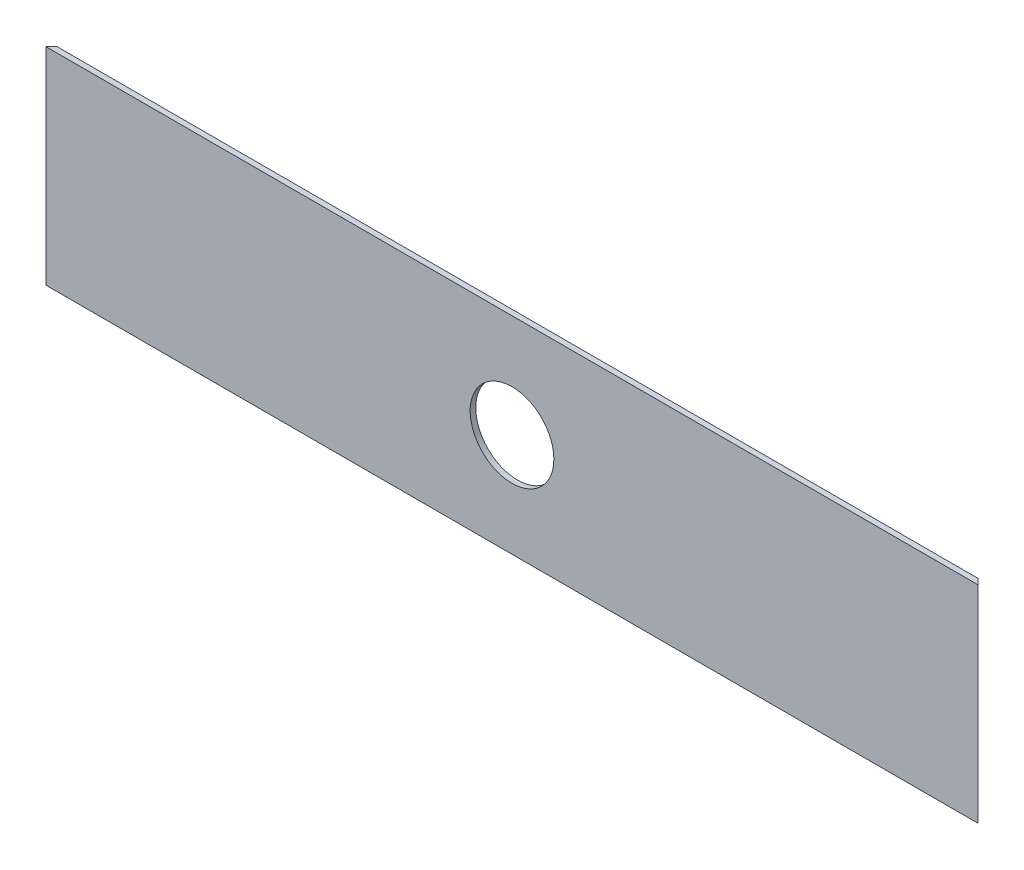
ISO-10303-21;
HEADER;
FILE_DESCRIPTION(('STEP AP214'),'2;1');
FILE_NAME('part.step','',(''),(''),'','','');
FILE_SCHEMA(('AUTOMOTIVE_DESIGN { 1 0 10303 214 1 1 1 1 }'));
ENDSEC;
DATA;
#1=APPLICATION_CONTEXT('core data for automotive mechanical design processes');
#2=APPLICATION_PROTOCOL_DEFINITION('international standard','automotive_design',2000,#1);
#3=PRODUCT_CONTEXT('',#1,'mechanical');
#4=PRODUCT('Part','Part','',(#3));
#5=PRODUCT_RELATED_PRODUCT_CATEGORY('part','',(#4));
#6=PRODUCT_DEFINITION_FORMATION('','',#4);
#7=PRODUCT_DEFINITION_CONTEXT('part definition',#1,'design');
#8=PRODUCT_DEFINITION('design','',#6,#7);
#9=PRODUCT_DEFINITION_SHAPE('','',#8);
#10=(LENGTH_UNIT() NAMED_UNIT(*) SI_UNIT(.MILLI.,.METRE.));
#11=(NAMED_UNIT(*) PLANE_ANGLE_UNIT() SI_UNIT($,.RADIAN.));
#12=(NAMED_UNIT(*) SI_UNIT($,.STERADIAN.) SOLID_ANGLE_UNIT());
#13=UNCERTAINTY_MEASURE_WITH_UNIT(LENGTH_MEASURE(1.E-05),#10,'distance_accuracy_value','');
#14=(GEOMETRIC_REPRESENTATION_CONTEXT(3) GLOBAL_UNCERTAINTY_ASSIGNED_CONTEXT((#13)) GLOBAL_UNIT_ASSIGNED_CONTEXT((#10,
#11,#12)) REPRESENTATION_CONTEXT('',''));
#15=CARTESIAN_POINT('',(0.,0.,0.));
#16=DIRECTION('',(0.,0.,1.));
#17=DIRECTION('',(1.,0.,0.));
#18=AXIS2_PLACEMENT_3D('',#15,#16,#17);
#19=CARTESIAN_POINT('',(0.,185.075,10.));
#20=DIRECTION('',(0.,0.,1.));
#21=DIRECTION('',(1.,0.,0.));
#22=AXIS2_PLACEMENT_3D('',#19,#20,#21);
#23=PLANE('',#22);
#24=CARTESIAN_POINT('',(0.,185.0772745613,10.));
#25=DIRECTION('',(0.,0.,1.));
#26=DIRECTION('',(1.,0.,0.));
#27=AXIS2_PLACEMENT_3D('',#24,#25,#26);
#28=CIRCLE('',#27,75.);
#29=CARTESIAN_POINT('',(75.,185.0772745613,10.));
#30=VERTEX_POINT('',#29);
#31=EDGE_CURVE('E10',#30,#30,#28,.T.);
#32=ORIENTED_EDGE('',*,*,#31,.F.);
#33=EDGE_LOOP('',(#32));
#34=FACE_BOUND('',#33,.T.);
#35=DIRECTION('',(1.,0.,0.));
#36=VECTOR('',#35,1.);
#37=CARTESIAN_POINT('',(-835.,0.,10.));
#38=LINE('',#37,#36);
#39=CARTESIAN_POINT('',(-835.,0.,10.));
#40=VERTEX_POINT('',#39);
#41=CARTESIAN_POINT('',(835.,0.,10.));
#42=VERTEX_POINT('',#41);
#43=EDGE_CURVE('E80',#40,#42,#38,.T.);
#44=ORIENTED_EDGE('',*,*,#43,.T.);
#45=DIRECTION('',(0.,1.,0.));
#46=VECTOR('',#45,1.);
#47=CARTESIAN_POINT('',(835.,0.,10.));
#48=LINE('',#47,#46);
#49=CARTESIAN_POINT('',(835.,370.15,10.));
#50=VERTEX_POINT('',#49);
#51=EDGE_CURVE('E19',#42,#50,#48,.T.);
#52=ORIENTED_EDGE('',*,*,#51,.T.);
#53=DIRECTION('',(-1.,0.,0.));
#54=VECTOR('',#53,1.);
#55=CARTESIAN_POINT('',(835.,370.15,10.));
#56=LINE('',#55,#54);
#57=CARTESIAN_POINT('',(-835.,370.15,10.));
#58=VERTEX_POINT('',#57);
#59=EDGE_CURVE('E115',#50,#58,#56,.T.);
#60=ORIENTED_EDGE('',*,*,#59,.T.);
#61=DIRECTION('',(0.,-1.,0.));
#62=VECTOR('',#61,1.);
#63=CARTESIAN_POINT('',(-835.,370.15,10.));
#64=LINE('',#63,#62);
#65=EDGE_CURVE('E86',#58,#40,#64,.T.);
#66=ORIENTED_EDGE('',*,*,#65,.T.);
#67=EDGE_LOOP('',(#44,#52,#60,#66));
#68=FACE_BOUND('',#67,.T.);
#69=ADVANCED_FACE('F16',(#34,#68),#23,.T.);
#70=CARTESIAN_POINT('',(0.,185.0772745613,-1.));
#71=DIRECTION('',(0.,0.,1.));
#72=DIRECTION('',(1.,0.,0.));
#73=AXIS2_PLACEMENT_3D('',#70,#71,#72);
#74=CYLINDRICAL_SURFACE('',#73,75.);
#75=DIRECTION('',(0.,0.,1.));
#76=VECTOR('',#75,1.);
#77=CARTESIAN_POINT('',(75.,185.0772745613,-1.));
#78=LINE('',#77,#76);
#79=CARTESIAN_POINT('',(75.,185.0772745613,0.));
#80=VERTEX_POINT('',#79);
#81=EDGE_CURVE('E26',#80,#30,#78,.T.);
#82=ORIENTED_EDGE('',*,*,#81,.F.);
#83=CARTESIAN_POINT('',(0.,185.0772745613,0.));
#84=DIRECTION('',(0.,0.,1.));
#85=DIRECTION('',(1.,0.,0.));
#86=AXIS2_PLACEMENT_3D('',#83,#84,#85);
#87=CIRCLE('',#86,75.);
#88=EDGE_CURVE('E87',#80,#80,#87,.T.);
#89=ORIENTED_EDGE('',*,*,#88,.F.);
#90=ORIENTED_EDGE('',*,*,#81,.T.);
#91=ORIENTED_EDGE('',*,*,#31,.T.);
#92=EDGE_LOOP('',(#82,#89,#90,#91));
#93=FACE_BOUND('',#92,.T.);
#94=ADVANCED_FACE('F176',(#93),#74,.F.);
#95=CARTESIAN_POINT('',(830.,185.075,5.));
#96=DIRECTION('',(0.707106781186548,0.,-0.707106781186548));
#97=DIRECTION('',(0.,-1.,0.));
#98=AXIS2_PLACEMENT_3D('',#95,#96,#97);
#99=PLANE('',#98);
#100=DIRECTION('',(0.,-1.,0.));
#101=VECTOR('',#100,1.);
#102=CARTESIAN_POINT('',(825.,370.15,0.));
#103=LINE('',#102,#101);
#104=CARTESIAN_POINT('',(825.,370.15,0.));
#105=VERTEX_POINT('',#104);
#106=CARTESIAN_POINT('',(825.,0.,0.));
#107=VERTEX_POINT('',#106);
#108=EDGE_CURVE('E95',#105,#107,#103,.T.);
#109=ORIENTED_EDGE('',*,*,#108,.F.);
#110=DIRECTION('',(0.707106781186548,0.,0.707106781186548));
#111=VECTOR('',#110,1.);
#112=CARTESIAN_POINT('',(825.,370.15,0.));
#113=LINE('',#112,#111);
#114=EDGE_CURVE('E111',#105,#50,#113,.T.);
#115=ORIENTED_EDGE('',*,*,#114,.T.);
#116=ORIENTED_EDGE('',*,*,#51,.F.);
#117=DIRECTION('',(0.707106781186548,0.,0.707106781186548));
#118=VECTOR('',#117,1.);
#119=CARTESIAN_POINT('',(825.,0.,0.));
#120=LINE('',#119,#118);
#121=EDGE_CURVE('E123',#107,#42,#120,.T.);
#122=ORIENTED_EDGE('',*,*,#121,.F.);
#123=EDGE_LOOP('',(#109,#115,#116,#122));
#124=FACE_BOUND('',#123,.T.);
#125=ADVANCED_FACE('F137',(#124),#99,.T.);
#126=CARTESIAN_POINT('',(0.,370.15,5.029866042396));
#127=DIRECTION('',(0.,1.,0.));
#128=DIRECTION('',(1.,0.,0.));
#129=AXIS2_PLACEMENT_3D('',#126,#127,#128);
#130=PLANE('',#129);
#131=DIRECTION('',(1.,0.,0.));
#132=VECTOR('',#131,1.);
#133=CARTESIAN_POINT('',(-825.,370.15,0.));
#134=LINE('',#133,#132);
#135=CARTESIAN_POINT('',(-825.,370.15,0.));
#136=VERTEX_POINT('',#135);
#137=EDGE_CURVE('E103',#136,#105,#134,.T.);
#138=ORIENTED_EDGE('',*,*,#137,.F.);
#139=DIRECTION('',(-0.707106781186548,0.,0.707106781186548));
#140=VECTOR('',#139,1.);
#141=CARTESIAN_POINT('',(-825.,370.15,0.));
#142=LINE('',#141,#140);
#143=EDGE_CURVE('E100',#136,#58,#142,.T.);
#144=ORIENTED_EDGE('',*,*,#143,.T.);
#145=ORIENTED_EDGE('',*,*,#59,.F.);
#146=ORIENTED_EDGE('',*,*,#114,.F.);
#147=EDGE_LOOP('',(#138,#144,#145,#146));
#148=FACE_BOUND('',#147,.T.);
#149=ADVANCED_FACE('F135',(#148),#130,.T.);
#150=CARTESIAN_POINT('',(0.,0.,5.029866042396));
#151=DIRECTION('',(0.,-1.,0.));
#152=DIRECTION('',(0.,0.,-1.));
#153=AXIS2_PLACEMENT_3D('',#150,#151,#152);
#154=PLANE('',#153);
#155=DIRECTION('',(-1.,0.,0.));
#156=VECTOR('',#155,1.);
#157=CARTESIAN_POINT('',(825.,0.,0.));
#158=LINE('',#157,#156);
#159=CARTESIAN_POINT('',(-825.,0.,0.));
#160=VERTEX_POINT('',#159);
#161=EDGE_CURVE('E77',#107,#160,#158,.T.);
#162=ORIENTED_EDGE('',*,*,#161,.F.);
#163=ORIENTED_EDGE('',*,*,#121,.T.);
#164=ORIENTED_EDGE('',*,*,#43,.F.);
#165=DIRECTION('',(0.707106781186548,0.,-0.707106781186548));
#166=VECTOR('',#165,1.);
#167=CARTESIAN_POINT('',(-835.,0.,10.));
#168=LINE('',#167,#166);
#169=EDGE_CURVE('E73',#40,#160,#168,.T.);
#170=ORIENTED_EDGE('',*,*,#169,.T.);
#171=EDGE_LOOP('',(#162,#163,#164,#170));
#172=FACE_BOUND('',#171,.T.);
#173=ADVANCED_FACE('F75',(#172),#154,.T.);
#174=CARTESIAN_POINT('',(-830.,185.075,5.));
#175=DIRECTION('',(-0.707106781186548,0.,-0.707106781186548));
#176=DIRECTION('',(-0.707106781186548,0.,0.707106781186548));
#177=AXIS2_PLACEMENT_3D('',#174,#175,#176);
#178=PLANE('',#177);
#179=DIRECTION('',(0.,1.,0.));
#180=VECTOR('',#179,1.);
#181=CARTESIAN_POINT('',(-825.,0.,0.));
#182=LINE('',#181,#180);
#183=EDGE_CURVE('E93',#160,#136,#182,.T.);
#184=ORIENTED_EDGE('',*,*,#183,.F.);
#185=ORIENTED_EDGE('',*,*,#169,.F.);
#186=ORIENTED_EDGE('',*,*,#65,.F.);
#187=ORIENTED_EDGE('',*,*,#143,.F.);
#188=EDGE_LOOP('',(#184,#185,#186,#187));
#189=FACE_BOUND('',#188,.T.);
#190=ADVANCED_FACE('F98',(#189),#178,.T.);
#191=CARTESIAN_POINT('',(0.,185.075,0.));
#192=DIRECTION('',(0.,0.,-1.));
#193=DIRECTION('',(0.,-1.,0.));
#194=AXIS2_PLACEMENT_3D('',#191,#192,#193);
#195=PLANE('',#194);
#196=ORIENTED_EDGE('',*,*,#88,.T.);
#197=EDGE_LOOP('',(#196));
#198=FACE_BOUND('',#197,.T.);
#199=ORIENTED_EDGE('',*,*,#183,.T.);
#200=ORIENTED_EDGE('',*,*,#137,.T.);
#201=ORIENTED_EDGE('',*,*,#108,.T.);
#202=ORIENTED_EDGE('',*,*,#161,.T.);
#203=EDGE_LOOP('',(#199,#200,#201,#202));
#204=FACE_BOUND('',#203,.T.);
#205=ADVANCED_FACE('F91',(#198,#204),#195,.T.);
#206=CLOSED_SHELL('',(#69,#94,#125,#149,#173,#190,#205));
#207=MANIFOLD_SOLID_BREP('B1',#206);
#208=ADVANCED_BREP_SHAPE_REPRESENTATION('',(#18,#207),#14);
#209=SHAPE_DEFINITION_REPRESENTATION(#9,#208);
ENDSEC;
END-ISO-10303-21;
